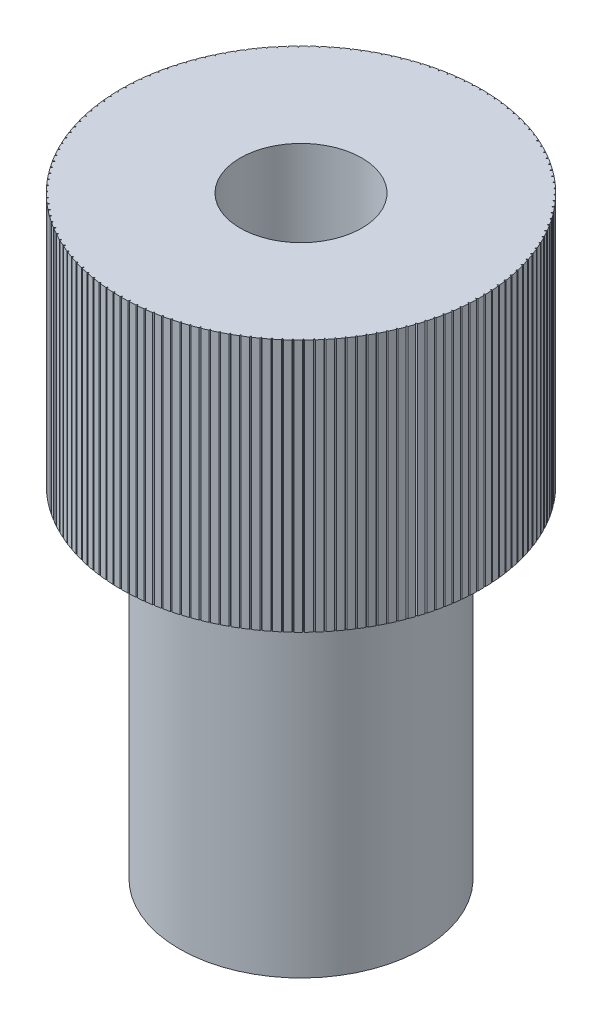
from build123d import *

# Parameters (mm, degrees)
CUT_EXTRUDE1_DEPTH = 17.85898093
SKETCH5_R          = 1.5875
CUT_EXTRUDE2_DEPTH = 17.858971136
CHAMFER1_SIZE      = 0.508
CHAMFER1_SIZE2     = 0.87988181


with BuildPart() as part:
    # Sketch1 → Revolve1 (revolve)
    with BuildSketch(Plane(origin=(0, 0, 0), x_dir=(0, 0, -1), z_dir=(1, 0, 0))):
        Polygon((4.699, 8.89), (3.175, 8.89), (3.175, 0), (0, 0), (0, 15.494), (4.699, 15.494), align=None)
    revolve(axis=Axis((0, 0, 0), (0, 1, 0)))

    # Sketch2 → Cut-Extrude1 (cut, through all)
    with BuildSketch(Plane(origin=(0, 15.494, 0), x_dir=(1, 0, 0), z_dir=(0, 1, 0))):
        with BuildLine():
            Line((0.01817215, 4.698964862), (0, 4.654012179))
            Line((0, 4.654012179), (-0.01817215, 4.698964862))
            ThreePointArc((-0.01817215, 4.698964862), (0, 4.699), (0.01817215, 4.698964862))
        make_face()
        with BuildLine():
            Line((0.214928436, 4.694082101), (0.194889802, 4.64992982))
            Line((0.194889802, 4.64992982), (0.178616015, 4.695604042))
            ThreePointArc((0.178616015, 4.695604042), (0.196773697, 4.694878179), (0.214928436, 4.694082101))
        make_face()
        with BuildLine():
            Line((0.411307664, 4.680964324), (0.389437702, 4.637689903))
            Line((0.389437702, 4.637689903), (0.375090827, 4.684005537))
            ThreePointArc((0.375090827, 4.684005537), (0.393202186, 4.682519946), (0.411307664, 4.680964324))
        make_face()
        with BuildLine():
            Line((0.606965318, 4.659634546), (0.583302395, 4.617313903))
            Line((0.583302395, 4.617313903), (0.570907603, 4.664189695))
            ThreePointArc((0.570907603, 4.664189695), (0.588940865, 4.661946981), (0.606965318, 4.659634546))
        make_face()
        with BuildLine():
            Line((0.801558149, 4.630130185), (0.776143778, 4.588837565))
            Line((0.776143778, 4.588837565), (0.765722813, 4.636191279))
            ThreePointArc((0.765722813, 4.636191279), (0.783646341, 4.633195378), (0.801558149, 4.630130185))
        make_face()
        with BuildLine():
            Line((0.994744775, 4.592503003), (0.967623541, 4.552310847))
            Line((0.967623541, 4.552310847), (0.959194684, 4.600059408))
            ThreePointArc((0.959194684, 4.600059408), (0.976977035, 4.596315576), (0.994744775, 4.592503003))
        make_face()
        with BuildLine():
            Line((1.18618628, 4.54681901), (1.157405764, 4.507797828))
            Line((1.157405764, 4.507797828), (1.150983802, 4.55585747))
            ThreePointArc((1.150983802, 4.55585747), (1.16859378, 4.551372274), (1.18618628, 4.54681901))
        make_face()
        with BuildLine():
            Line((1.375546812, 4.493158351), (1.345157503, 4.455376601))
            Line((1.345157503, 4.455376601), (1.340753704, 4.50366301))
            ThreePointArc((1.340753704, 4.50366301), (1.358160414, 4.498444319), (1.375546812, 4.493158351))
        make_face()
        with BuildLine():
            Line((1.562494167, 4.431615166), (1.530549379, 4.395139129))
            Line((1.530549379, 4.395139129), (1.528171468, 4.443567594))
            ThreePointArc((1.528171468, 4.443567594), (1.545344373, 4.437624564), (1.562494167, 4.431615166))
        make_face()
        with BuildLine():
            Line((1.746700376, 4.362297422), (1.713256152, 4.327191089))
            Line((1.713256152, 4.327191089), (1.7129083, 4.375676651))
            ThreePointArc((1.7129083, 4.375676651), (1.729817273, 4.369019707), (1.746700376, 4.362297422))
        make_face()
        with BuildLine():
            Line((1.927842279, 4.285326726), (1.892957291, 4.251651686))
            Line((1.892957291, 4.251651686), (1.894640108, 4.300109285))
            ThreePointArc((1.894640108, 4.300109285), (1.911255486, 4.292750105), (1.927842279, 4.285326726))
        make_face()
        with BuildLine():
            Line((2.105602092, 4.20083811), (2.069337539, 4.168653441))
            Line((2.069337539, 4.168653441), (2.073048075, 4.216998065))
            ThreePointArc((2.073048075, 4.216998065), (2.089340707, 4.208949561), (2.105602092, 4.20083811))
        make_face()
        with BuildLine():
            Line((2.279667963, 4.108979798), (2.242087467, 4.078341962))
            Line((2.242087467, 4.078341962), (2.24781921, 4.126488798))
            ThreePointArc((2.24781921, 4.126488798), (2.263760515, 4.11776509), (2.279667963, 4.108979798))
        make_face()
        with BuildLine():
            Line((2.449734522, 4.009912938), (2.410904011, 3.980875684))
            Line((2.410904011, 3.980875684), (2.418646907, 4.028740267))
            ThreePointArc((2.418646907, 4.028740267), (2.434208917, 4.019356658), (2.449734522, 4.009912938))
        make_face()
        with BuildLine():
            Line((2.615503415, 3.903811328), (2.57549101, 3.876425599))
            Line((2.57549101, 3.876425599), (2.585231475, 3.923923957))
            ThreePointArc((2.585231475, 3.923923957), (2.60038689, 3.91389691), (2.615503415, 3.903811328))
        make_face()
        with BuildLine():
            Line((2.776683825, 3.790861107), (2.735559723, 3.765174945))
            Line((2.735559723, 3.765174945), (2.747280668, 3.812223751))
            ThreePointArc((2.747280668, 3.812223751), (2.762002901, 3.801570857), (2.776683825, 3.790861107))
        make_face()
        with BuildLine():
            Line((2.932992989, 3.671260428), (2.890829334, 3.647318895))
            Line((2.890829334, 3.647318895), (2.904510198, 3.693835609))
            ThreePointArc((2.904510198, 3.693835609), (2.91877342, 3.682575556), (2.932992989, 3.671260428))
        make_face()
        with BuildLine():
            Line((3.084156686, 3.54521911), (3.041027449, 3.523064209))
            Line((3.041027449, 3.523064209), (3.05664423, 3.568967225))
            ThreePointArc((3.05664423, 3.568967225), (3.070423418, 3.557119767), (3.084156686, 3.54521911))
        make_face()
        with BuildLine():
            Line((3.229909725, 3.412958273), (3.185890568, 3.39262887))
            Line((3.185890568, 3.39262887), (3.20341587, 3.437837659))
            ThreePointArc((3.20341587, 3.437837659), (3.216686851, 3.42542358), (3.229909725, 3.412958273))
        make_face()
        with BuildLine():
            Line((3.369996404, 3.274709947), (3.325164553, 3.256241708))
            Line((3.325164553, 3.256241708), (3.344567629, 3.300676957))
            ThreePointArc((3.344567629, 3.300676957), (3.357307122, 3.287718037), (3.369996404, 3.274709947))
        make_face()
        with BuildLine():
            Line((3.504170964, 3.130716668), (3.458605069, 3.114141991))
            Line((3.458605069, 3.114141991), (3.47985188, 3.157725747))
            ThreePointArc((3.47985188, 3.157725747), (3.492037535, 3.144244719), (3.504170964, 3.130716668))
        make_face()
        with BuildLine():
            Line((3.632198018, 2.981231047), (3.585978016, 2.966579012))
            Line((3.585978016, 2.966579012), (3.609031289, 3.009234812))
            ThreePointArc((3.609031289, 3.009234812), (3.620641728, 2.995255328), (3.632198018, 2.981231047))
        make_face()
        with BuildLine():
            Line((3.753852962, 2.826515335), (3.70705994, 2.813811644))
            Line((3.70705994, 2.813811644), (3.73187923, 2.855464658))
            ThreePointArc((3.73187923, 2.855464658), (3.742894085, 2.841011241), (3.753852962, 2.826515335))
        make_face()
        with BuildLine():
            Line((3.868922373, 2.666840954), (3.82163842, 2.656107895))
            Line((3.82163842, 2.656107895), (3.848180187, 2.696685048))
            ThreePointArc((3.848180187, 2.696685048), (3.858580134, 2.681783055), (3.868922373, 2.666840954))
        make_face()
        with BuildLine():
            Line((3.977204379, 2.502488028), (3.929512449, 2.49374443))
            Line((3.929512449, 2.49374443), (3.957730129, 2.533174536))
            ThreePointArc((3.957730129, 2.533174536), (3.967496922, 2.51785011), (3.977204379, 2.502488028))
        make_face()
        with BuildLine():
            Line((4.078509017, 2.333744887), (4.030492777, 2.32700609))
            Line((4.030492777, 2.32700609), (4.060336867, 2.365219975))
            ThreePointArc((4.060336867, 2.365219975), (4.069453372, 2.3495), (4.078509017, 2.333744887))
        make_face()
        with BuildLine():
            Line((4.172658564, 2.160907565), (4.124402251, 2.15618539))
            Line((4.124402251, 2.15618539), (4.155820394, 2.193116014))
            ThreePointArc((4.155820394, 2.193116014), (4.164270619, 2.177028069), (4.172658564, 2.160907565))
        make_face()
        with BuildLine():
            Line((4.259487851, 1.984279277), (4.211076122, 1.981582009))
            Line((4.211076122, 1.981582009), (4.2440132, 2.017164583))
            ThreePointArc((4.2440132, 2.017164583), (4.25178232, 2.000736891), (4.259487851, 1.984279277))
        make_face()
        with BuildLine():
            Line((4.338844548, 1.804169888), (4.290362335, 1.803502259))
            Line((4.290362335, 1.803502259), (4.324760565, 1.83767436))
            ThreePointArc((4.324760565, 1.83767436), (4.331834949, 1.820935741), (4.338844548, 1.804169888))
        make_face()
        with BuildLine():
            Line((4.410589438, 1.620895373), (4.362121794, 1.622258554))
            Line((4.362121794, 1.622258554), (4.397920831, 1.654960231))
            ThreePointArc((4.397920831, 1.654960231), (4.404288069, 1.63794005), (4.410589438, 1.620895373))
        make_face()
        with BuildLine():
            Line((4.474596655, 1.434777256), (4.42622861, 1.438168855))
            Line((4.42622861, 1.438168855), (4.463365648, 1.46934274))
            ThreePointArc((4.463365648, 1.46934274), (4.46901457, 1.452070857), (4.474596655, 1.434777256))
        make_face()
        with BuildLine():
            Line((4.530753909, 1.246142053), (4.482570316, 1.25155612))
            Line((4.482570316, 1.25155612), (4.520980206, 1.281147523))
            ThreePointArc((4.520980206, 1.281147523), (4.525900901, 1.263654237), (4.530753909, 1.246142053))
        make_face()
        with BuildLine():
            Line((4.578962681, 1.055320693), (4.531048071, 1.062747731))
            Line((4.531048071, 1.062747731), (4.570663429, 1.090704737))
            ThreePointArc((4.570663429, 1.090704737), (4.574847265, 1.073020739), (4.578962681, 1.055320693))
        make_face()
        with BuildLine():
            Line((4.619138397, 0.862647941), (4.571576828, 0.87207492))
            Line((4.571576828, 0.87207492), (4.612328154, 0.898348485))
            ThreePointArc((4.612328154, 0.898348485), (4.615767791, 0.880504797), (4.619138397, 0.862647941))
        make_face()
        with BuildLine():
            Line((4.651210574, 0.668461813), (4.604085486, 0.679872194))
            Line((4.604085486, 0.679872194), (4.645901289, 0.704416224))
            ThreePointArc((4.645901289, 0.704416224), (4.648590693, 0.686444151), (4.651210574, 0.668461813))
        make_face()
        with BuildLine():
            Line((4.675122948, 0.473102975), (4.628517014, 0.486476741))
            Line((4.628517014, 0.486476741), (4.671323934, 0.509248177))
            ThreePointArc((4.671323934, 0.509248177), (4.673258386, 0.491179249), (4.675122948, 0.473102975))
        make_face()
        with BuildLine():
            Line((4.690833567, 0.276914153), (4.644828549, 0.292227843))
            Line((4.644828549, 0.292227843), (4.688551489, 0.313186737))
            ThreePointArc((4.688551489, 0.313186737), (4.689727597, 0.295052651), (4.690833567, 0.276914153))
        make_face()
        with BuildLine():
            Line((4.69831487, 0.08023953), (4.652991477, 0.097466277))
            Line((4.652991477, 0.097466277), (4.697553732, 0.11657586))
            ThreePointArc((4.697553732, 0.11657586), (4.697969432, 0.098408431), (4.69831487, 0.08023953))
        make_face()
        with BuildLine():
            Line((4.697553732, -0.11657586), (4.652991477, -0.097466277))
            Line((4.652991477, -0.097466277), (4.69831487, -0.08023953))
            ThreePointArc((4.69831487, -0.08023953), (4.697969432, -0.098408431), (4.697553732, -0.11657586))
        make_face()
        with BuildLine():
            Line((4.688551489, -0.313186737), (4.644828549, -0.292227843))
            Line((4.644828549, -0.292227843), (4.690833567, -0.276914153))
            ThreePointArc((4.690833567, -0.276914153), (4.689727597, -0.295052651), (4.688551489, -0.313186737))
        make_face()
        with BuildLine():
            Line((4.671323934, -0.509248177), (4.628517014, -0.486476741))
            Line((4.628517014, -0.486476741), (4.675122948, -0.473102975))
            ThreePointArc((4.675122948, -0.473102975), (4.673258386, -0.491179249), (4.671323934, -0.509248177))
        make_face()
        with BuildLine():
            Line((4.645901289, -0.704416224), (4.604085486, -0.679872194))
            Line((4.604085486, -0.679872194), (4.651210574, -0.668461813))
            ThreePointArc((4.651210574, -0.668461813), (4.648590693, -0.686444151), (4.645901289, -0.704416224))
        make_face()
        with BuildLine():
            Line((4.612328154, -0.898348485), (4.571576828, -0.87207492))
            Line((4.571576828, -0.87207492), (4.619138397, -0.862647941))
            ThreePointArc((4.619138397, -0.862647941), (4.615767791, -0.880504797), (4.612328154, -0.898348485))
        make_face()
        with BuildLine():
            Line((4.570663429, -1.090704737), (4.531048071, -1.062747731))
            Line((4.531048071, -1.062747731), (4.578962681, -1.055320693))
            ThreePointArc((4.578962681, -1.055320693), (4.574847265, -1.073020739), (4.570663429, -1.090704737))
        make_face()
        with BuildLine():
            Line((4.520980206, -1.281147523), (4.482570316, -1.25155612))
            Line((4.482570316, -1.25155612), (4.530753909, -1.246142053))
            ThreePointArc((4.530753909, -1.246142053), (4.525900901, -1.263654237), (4.520980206, -1.281147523))
        make_face()
        with BuildLine():
            Line((4.463365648, -1.46934274), (4.42622861, -1.438168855))
            Line((4.42622861, -1.438168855), (4.474596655, -1.434777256))
            ThreePointArc((4.474596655, -1.434777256), (4.46901457, -1.452070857), (4.463365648, -1.46934274))
        make_face()
        with BuildLine():
            Line((4.397920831, -1.654960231), (4.362121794, -1.622258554))
            Line((4.362121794, -1.622258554), (4.410589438, -1.620895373))
            ThreePointArc((4.410589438, -1.620895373), (4.404288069, -1.63794005), (4.397920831, -1.654960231))
        make_face()
        with BuildLine():
            Line((4.324760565, -1.83767436), (4.290362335, -1.803502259))
            Line((4.290362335, -1.803502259), (4.338844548, -1.804169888))
            ThreePointArc((4.338844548, -1.804169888), (4.331834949, -1.820935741), (4.324760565, -1.83767436))
        make_face()
        with BuildLine():
            Line((4.2440132, -2.017164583), (4.211076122, -1.981582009))
            Line((4.211076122, -1.981582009), (4.259487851, -1.984279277))
            ThreePointArc((4.259487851, -1.984279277), (4.25178232, -2.000736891), (4.2440132, -2.017164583))
        make_face()
        with BuildLine():
            Line((4.155820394, -2.193116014), (4.124402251, -2.15618539))
            Line((4.124402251, -2.15618539), (4.172658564, -2.160907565))
            ThreePointArc((4.172658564, -2.160907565), (4.164270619, -2.177028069), (4.155820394, -2.193116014))
        make_face()
        with BuildLine():
            Line((4.060336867, -2.365219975), (4.030492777, -2.32700609))
            Line((4.030492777, -2.32700609), (4.078509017, -2.333744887))
            ThreePointArc((4.078509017, -2.333744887), (4.069453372, -2.3495), (4.060336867, -2.365219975))
        make_face()
        with BuildLine():
            Line((3.957730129, -2.533174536), (3.929512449, -2.49374443))
            Line((3.929512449, -2.49374443), (3.977204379, -2.502488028))
            ThreePointArc((3.977204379, -2.502488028), (3.967496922, -2.51785011), (3.957730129, -2.533174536))
        make_face()
        with BuildLine():
            Line((3.848180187, -2.696685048), (3.82163842, -2.656107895))
            Line((3.82163842, -2.656107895), (3.868922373, -2.666840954))
            ThreePointArc((3.868922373, -2.666840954), (3.858580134, -2.681783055), (3.848180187, -2.696685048))
        make_face()
        with BuildLine():
            Line((3.73187923, -2.855464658), (3.70705994, -2.813811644))
            Line((3.70705994, -2.813811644), (3.753852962, -2.826515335))
            ThreePointArc((3.753852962, -2.826515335), (3.742894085, -2.841011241), (3.73187923, -2.855464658))
        make_face()
        with BuildLine():
            Line((3.609031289, -3.009234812), (3.585978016, -2.966579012))
            Line((3.585978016, -2.966579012), (3.632198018, -2.981231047))
            ThreePointArc((3.632198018, -2.981231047), (3.620641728, -2.995255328), (3.609031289, -3.009234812))
        make_face()
        with BuildLine():
            Line((3.47985188, -3.157725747), (3.458605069, -3.114141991))
            Line((3.458605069, -3.114141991), (3.504170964, -3.130716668))
            ThreePointArc((3.504170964, -3.130716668), (3.492037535, -3.144244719), (3.47985188, -3.157725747))
        make_face()
        with BuildLine():
            Line((3.344567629, -3.300676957), (3.325164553, -3.256241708))
            Line((3.325164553, -3.256241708), (3.369996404, -3.274709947))
            ThreePointArc((3.369996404, -3.274709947), (3.357307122, -3.287718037), (3.344567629, -3.300676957))
        make_face()
        with BuildLine():
            Line((3.20341587, -3.437837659), (3.185890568, -3.39262887))
            Line((3.185890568, -3.39262887), (3.229909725, -3.412958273))
            ThreePointArc((3.229909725, -3.412958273), (3.216686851, -3.42542358), (3.20341587, -3.437837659))
        make_face()
        with BuildLine():
            Line((3.05664423, -3.568967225), (3.041027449, -3.523064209))
            Line((3.041027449, -3.523064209), (3.084156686, -3.54521911))
            ThreePointArc((3.084156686, -3.54521911), (3.070423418, -3.557119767), (3.05664423, -3.568967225))
        make_face()
        with BuildLine():
            Line((2.904510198, -3.693835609), (2.890829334, -3.647318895))
            Line((2.890829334, -3.647318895), (2.932992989, -3.671260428))
            ThreePointArc((2.932992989, -3.671260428), (2.91877342, -3.682575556), (2.904510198, -3.693835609))
        make_face()
        with BuildLine():
            Line((2.747280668, -3.812223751), (2.735559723, -3.765174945))
            Line((2.735559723, -3.765174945), (2.776683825, -3.790861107))
            ThreePointArc((2.776683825, -3.790861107), (2.762002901, -3.801570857), (2.747280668, -3.812223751))
        make_face()
        with BuildLine():
            Line((2.585231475, -3.923923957), (2.57549101, -3.876425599))
            Line((2.57549101, -3.876425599), (2.615503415, -3.903811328))
            ThreePointArc((2.615503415, -3.903811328), (2.60038689, -3.91389691), (2.585231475, -3.923923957))
        make_face()
        with BuildLine():
            Line((2.418646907, -4.028740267), (2.410904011, -3.980875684))
            Line((2.410904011, -3.980875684), (2.449734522, -4.009912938))
            ThreePointArc((2.449734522, -4.009912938), (2.434208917, -4.019356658), (2.418646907, -4.028740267))
        make_face()
        with BuildLine():
            Line((2.24781921, -4.126488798), (2.242087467, -4.078341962))
            Line((2.242087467, -4.078341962), (2.279667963, -4.108979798))
            ThreePointArc((2.279667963, -4.108979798), (2.263760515, -4.11776509), (2.24781921, -4.126488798))
        make_face()
        with BuildLine():
            Line((2.073048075, -4.216998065), (2.069337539, -4.168653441))
            Line((2.069337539, -4.168653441), (2.105602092, -4.20083811))
            ThreePointArc((2.105602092, -4.20083811), (2.089340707, -4.208949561), (2.073048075, -4.216998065))
        make_face()
        with BuildLine():
            Line((1.894640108, -4.300109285), (1.892957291, -4.251651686))
            Line((1.892957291, -4.251651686), (1.927842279, -4.285326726))
            ThreePointArc((1.927842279, -4.285326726), (1.911255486, -4.292750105), (1.894640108, -4.300109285))
        make_face()
        with BuildLine():
            Line((1.7129083, -4.375676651), (1.713256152, -4.327191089))
            Line((1.713256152, -4.327191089), (1.746700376, -4.362297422))
            ThreePointArc((1.746700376, -4.362297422), (1.729817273, -4.369019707), (1.7129083, -4.375676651))
        make_face()
        with BuildLine():
            Line((1.528171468, -4.443567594), (1.530549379, -4.395139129))
            Line((1.530549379, -4.395139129), (1.562494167, -4.431615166))
            ThreePointArc((1.562494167, -4.431615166), (1.545344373, -4.437624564), (1.528171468, -4.443567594))
        make_face()
        with BuildLine():
            Line((1.340753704, -4.50366301), (1.345157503, -4.455376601))
            Line((1.345157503, -4.455376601), (1.375546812, -4.493158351))
            ThreePointArc((1.375546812, -4.493158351), (1.358160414, -4.498444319), (1.340753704, -4.50366301))
        make_face()
        with BuildLine():
            Line((1.150983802, -4.55585747), (1.157405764, -4.507797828))
            Line((1.157405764, -4.507797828), (1.18618628, -4.54681901))
            ThreePointArc((1.18618628, -4.54681901), (1.16859378, -4.551372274), (1.150983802, -4.55585747))
        make_face()
        with BuildLine():
            Line((0.959194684, -4.600059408), (0.967623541, -4.552310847))
            Line((0.967623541, -4.552310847), (0.994744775, -4.592503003))
            ThreePointArc((0.994744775, -4.592503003), (0.976977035, -4.596315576), (0.959194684, -4.600059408))
        make_face()
        with BuildLine():
            Line((0.765722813, -4.636191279), (0.776143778, -4.588837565))
            Line((0.776143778, -4.588837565), (0.801558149, -4.630130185))
            ThreePointArc((0.801558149, -4.630130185), (0.783646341, -4.633195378), (0.765722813, -4.636191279))
        make_face()
        with BuildLine():
            Line((0.570907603, -4.664189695), (0.583302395, -4.617313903))
            Line((0.583302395, -4.617313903), (0.606965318, -4.659634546))
            ThreePointArc((0.606965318, -4.659634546), (0.588940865, -4.661946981), (0.570907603, -4.664189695))
        make_face()
        with BuildLine():
            Line((0.375090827, -4.684005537), (0.389437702, -4.637689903))
            Line((0.389437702, -4.637689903), (0.411307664, -4.680964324))
            ThreePointArc((0.411307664, -4.680964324), (0.393202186, -4.682519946), (0.375090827, -4.684005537))
        make_face()
        with BuildLine():
            Line((0.178616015, -4.695604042), (0.194889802, -4.64992982))
            Line((0.194889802, -4.64992982), (0.214928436, -4.694082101))
            ThreePointArc((0.214928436, -4.694082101), (0.196773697, -4.694878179), (0.178616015, -4.695604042))
        make_face()
        with BuildLine():
            Line((-0.01817215, -4.698964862), (0, -4.654012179))
            Line((0, -4.654012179), (0.01817215, -4.698964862))
            ThreePointArc((0.01817215, -4.698964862), (0, -4.699), (-0.01817215, -4.698964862))
        make_face()
        with BuildLine():
            Line((-0.214928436, -4.694082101), (-0.194889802, -4.64992982))
            Line((-0.194889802, -4.64992982), (-0.178616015, -4.695604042))
            ThreePointArc((-0.178616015, -4.695604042), (-0.196773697, -4.694878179), (-0.214928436, -4.694082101))
        make_face()
        with BuildLine():
            Line((-0.411307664, -4.680964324), (-0.389437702, -4.637689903))
            Line((-0.389437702, -4.637689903), (-0.375090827, -4.684005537))
            ThreePointArc((-0.375090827, -4.684005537), (-0.393202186, -4.682519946), (-0.411307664, -4.680964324))
        make_face()
        with BuildLine():
            Line((-0.606965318, -4.659634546), (-0.583302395, -4.617313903))
            Line((-0.583302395, -4.617313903), (-0.570907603, -4.664189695))
            ThreePointArc((-0.570907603, -4.664189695), (-0.588940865, -4.661946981), (-0.606965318, -4.659634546))
        make_face()
        with BuildLine():
            Line((-0.801558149, -4.630130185), (-0.776143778, -4.588837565))
            Line((-0.776143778, -4.588837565), (-0.765722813, -4.636191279))
            ThreePointArc((-0.765722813, -4.636191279), (-0.783646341, -4.633195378), (-0.801558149, -4.630130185))
        make_face()
        with BuildLine():
            Line((-0.994744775, -4.592503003), (-0.967623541, -4.552310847))
            Line((-0.967623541, -4.552310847), (-0.959194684, -4.600059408))
            ThreePointArc((-0.959194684, -4.600059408), (-0.976977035, -4.596315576), (-0.994744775, -4.592503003))
        make_face()
        with BuildLine():
            Line((-1.18618628, -4.54681901), (-1.157405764, -4.507797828))
            Line((-1.157405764, -4.507797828), (-1.150983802, -4.55585747))
            ThreePointArc((-1.150983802, -4.55585747), (-1.16859378, -4.551372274), (-1.18618628, -4.54681901))
        make_face()
        with BuildLine():
            Line((-1.375546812, -4.493158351), (-1.345157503, -4.455376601))
            Line((-1.345157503, -4.455376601), (-1.340753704, -4.50366301))
            ThreePointArc((-1.340753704, -4.50366301), (-1.358160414, -4.498444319), (-1.375546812, -4.493158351))
        make_face()
        with BuildLine():
            Line((-1.562494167, -4.431615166), (-1.530549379, -4.395139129))
            Line((-1.530549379, -4.395139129), (-1.528171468, -4.443567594))
            ThreePointArc((-1.528171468, -4.443567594), (-1.545344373, -4.437624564), (-1.562494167, -4.431615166))
        make_face()
        with BuildLine():
            Line((-1.746700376, -4.362297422), (-1.713256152, -4.327191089))
            Line((-1.713256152, -4.327191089), (-1.7129083, -4.375676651))
            ThreePointArc((-1.7129083, -4.375676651), (-1.729817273, -4.369019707), (-1.746700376, -4.362297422))
        make_face()
        with BuildLine():
            Line((-1.927842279, -4.285326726), (-1.892957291, -4.251651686))
            Line((-1.892957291, -4.251651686), (-1.894640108, -4.300109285))
            ThreePointArc((-1.894640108, -4.300109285), (-1.911255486, -4.292750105), (-1.927842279, -4.285326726))
        make_face()
        with BuildLine():
            Line((-2.105602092, -4.20083811), (-2.069337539, -4.168653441))
            Line((-2.069337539, -4.168653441), (-2.073048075, -4.216998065))
            ThreePointArc((-2.073048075, -4.216998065), (-2.089340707, -4.208949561), (-2.105602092, -4.20083811))
        make_face()
        with BuildLine():
            Line((-2.279667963, -4.108979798), (-2.242087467, -4.078341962))
            Line((-2.242087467, -4.078341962), (-2.24781921, -4.126488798))
            ThreePointArc((-2.24781921, -4.126488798), (-2.263760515, -4.11776509), (-2.279667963, -4.108979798))
        make_face()
        with BuildLine():
            Line((-2.449734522, -4.009912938), (-2.410904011, -3.980875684))
            Line((-2.410904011, -3.980875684), (-2.418646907, -4.028740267))
            ThreePointArc((-2.418646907, -4.028740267), (-2.434208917, -4.019356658), (-2.449734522, -4.009912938))
        make_face()
        with BuildLine():
            Line((-2.615503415, -3.903811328), (-2.57549101, -3.876425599))
            Line((-2.57549101, -3.876425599), (-2.585231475, -3.923923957))
            ThreePointArc((-2.585231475, -3.923923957), (-2.60038689, -3.91389691), (-2.615503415, -3.903811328))
        make_face()
        with BuildLine():
            Line((-2.776683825, -3.790861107), (-2.735559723, -3.765174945))
            Line((-2.735559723, -3.765174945), (-2.747280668, -3.812223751))
            ThreePointArc((-2.747280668, -3.812223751), (-2.762002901, -3.801570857), (-2.776683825, -3.790861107))
        make_face()
        with BuildLine():
            Line((-2.932992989, -3.671260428), (-2.890829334, -3.647318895))
            Line((-2.890829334, -3.647318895), (-2.904510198, -3.693835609))
            ThreePointArc((-2.904510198, -3.693835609), (-2.91877342, -3.682575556), (-2.932992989, -3.671260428))
        make_face()
        with BuildLine():
            Line((-3.084156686, -3.54521911), (-3.041027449, -3.523064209))
            Line((-3.041027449, -3.523064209), (-3.05664423, -3.568967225))
            ThreePointArc((-3.05664423, -3.568967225), (-3.070423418, -3.557119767), (-3.084156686, -3.54521911))
        make_face()
        with BuildLine():
            Line((-3.229909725, -3.412958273), (-3.185890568, -3.39262887))
            Line((-3.185890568, -3.39262887), (-3.20341587, -3.437837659))
            ThreePointArc((-3.20341587, -3.437837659), (-3.216686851, -3.42542358), (-3.229909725, -3.412958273))
        make_face()
        with BuildLine():
            Line((-3.369996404, -3.274709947), (-3.325164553, -3.256241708))
            Line((-3.325164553, -3.256241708), (-3.344567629, -3.300676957))
            ThreePointArc((-3.344567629, -3.300676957), (-3.357307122, -3.287718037), (-3.369996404, -3.274709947))
        make_face()
        with BuildLine():
            Line((-3.504170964, -3.130716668), (-3.458605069, -3.114141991))
            Line((-3.458605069, -3.114141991), (-3.47985188, -3.157725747))
            ThreePointArc((-3.47985188, -3.157725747), (-3.492037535, -3.144244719), (-3.504170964, -3.130716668))
        make_face()
        with BuildLine():
            Line((-3.632198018, -2.981231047), (-3.585978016, -2.966579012))
            Line((-3.585978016, -2.966579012), (-3.609031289, -3.009234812))
            ThreePointArc((-3.609031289, -3.009234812), (-3.620641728, -2.995255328), (-3.632198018, -2.981231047))
        make_face()
        with BuildLine():
            Line((-3.753852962, -2.826515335), (-3.70705994, -2.813811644))
            Line((-3.70705994, -2.813811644), (-3.73187923, -2.855464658))
            ThreePointArc((-3.73187923, -2.855464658), (-3.742894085, -2.841011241), (-3.753852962, -2.826515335))
        make_face()
        with BuildLine():
            Line((-3.868922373, -2.666840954), (-3.82163842, -2.656107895))
            Line((-3.82163842, -2.656107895), (-3.848180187, -2.696685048))
            ThreePointArc((-3.848180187, -2.696685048), (-3.858580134, -2.681783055), (-3.868922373, -2.666840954))
        make_face()
        with BuildLine():
            Line((-3.977204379, -2.502488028), (-3.929512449, -2.49374443))
            Line((-3.929512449, -2.49374443), (-3.957730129, -2.533174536))
            ThreePointArc((-3.957730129, -2.533174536), (-3.967496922, -2.51785011), (-3.977204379, -2.502488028))
        make_face()
        with BuildLine():
            Line((-4.078509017, -2.333744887), (-4.030492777, -2.32700609))
            Line((-4.030492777, -2.32700609), (-4.060336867, -2.365219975))
            ThreePointArc((-4.060336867, -2.365219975), (-4.069453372, -2.3495), (-4.078509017, -2.333744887))
        make_face()
        with BuildLine():
            Line((-4.172658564, -2.160907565), (-4.124402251, -2.15618539))
            Line((-4.124402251, -2.15618539), (-4.155820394, -2.193116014))
            ThreePointArc((-4.155820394, -2.193116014), (-4.164270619, -2.177028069), (-4.172658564, -2.160907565))
        make_face()
        with BuildLine():
            Line((-4.259487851, -1.984279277), (-4.211076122, -1.981582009))
            Line((-4.211076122, -1.981582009), (-4.2440132, -2.017164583))
            ThreePointArc((-4.2440132, -2.017164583), (-4.25178232, -2.000736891), (-4.259487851, -1.984279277))
        make_face()
        with BuildLine():
            Line((-4.338844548, -1.804169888), (-4.290362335, -1.803502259))
            Line((-4.290362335, -1.803502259), (-4.324760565, -1.83767436))
            ThreePointArc((-4.324760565, -1.83767436), (-4.331834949, -1.820935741), (-4.338844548, -1.804169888))
        make_face()
        with BuildLine():
            Line((-4.410589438, -1.620895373), (-4.362121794, -1.622258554))
            Line((-4.362121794, -1.622258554), (-4.397920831, -1.654960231))
            ThreePointArc((-4.397920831, -1.654960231), (-4.404288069, -1.63794005), (-4.410589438, -1.620895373))
        make_face()
        with BuildLine():
            Line((-4.474596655, -1.434777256), (-4.42622861, -1.438168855))
            Line((-4.42622861, -1.438168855), (-4.463365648, -1.46934274))
            ThreePointArc((-4.463365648, -1.46934274), (-4.46901457, -1.452070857), (-4.474596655, -1.434777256))
        make_face()
        with BuildLine():
            Line((-4.530753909, -1.246142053), (-4.482570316, -1.25155612))
            Line((-4.482570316, -1.25155612), (-4.520980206, -1.281147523))
            ThreePointArc((-4.520980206, -1.281147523), (-4.525900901, -1.263654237), (-4.530753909, -1.246142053))
        make_face()
        with BuildLine():
            Line((-4.578962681, -1.055320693), (-4.531048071, -1.062747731))
            Line((-4.531048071, -1.062747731), (-4.570663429, -1.090704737))
            ThreePointArc((-4.570663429, -1.090704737), (-4.574847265, -1.073020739), (-4.578962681, -1.055320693))
        make_face()
        with BuildLine():
            Line((-4.619138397, -0.862647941), (-4.571576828, -0.87207492))
            Line((-4.571576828, -0.87207492), (-4.612328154, -0.898348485))
            ThreePointArc((-4.612328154, -0.898348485), (-4.615767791, -0.880504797), (-4.619138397, -0.862647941))
        make_face()
        with BuildLine():
            Line((-4.651210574, -0.668461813), (-4.604085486, -0.679872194))
            Line((-4.604085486, -0.679872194), (-4.645901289, -0.704416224))
            ThreePointArc((-4.645901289, -0.704416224), (-4.648590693, -0.686444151), (-4.651210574, -0.668461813))
        make_face()
        with BuildLine():
            Line((-4.675122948, -0.473102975), (-4.628517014, -0.486476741))
            Line((-4.628517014, -0.486476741), (-4.671323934, -0.509248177))
            ThreePointArc((-4.671323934, -0.509248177), (-4.673258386, -0.491179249), (-4.675122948, -0.473102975))
        make_face()
        with BuildLine():
            Line((-4.690833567, -0.276914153), (-4.644828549, -0.292227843))
            Line((-4.644828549, -0.292227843), (-4.688551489, -0.313186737))
            ThreePointArc((-4.688551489, -0.313186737), (-4.689727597, -0.295052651), (-4.690833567, -0.276914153))
        make_face()
        with BuildLine():
            Line((-4.69831487, -0.08023953), (-4.652991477, -0.097466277))
            Line((-4.652991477, -0.097466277), (-4.697553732, -0.11657586))
            ThreePointArc((-4.697553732, -0.11657586), (-4.697969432, -0.098408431), (-4.69831487, -0.08023953))
        make_face()
        with BuildLine():
            Line((-4.697553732, 0.11657586), (-4.652991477, 0.097466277))
            Line((-4.652991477, 0.097466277), (-4.69831487, 0.08023953))
            ThreePointArc((-4.69831487, 0.08023953), (-4.697969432, 0.098408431), (-4.697553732, 0.11657586))
        make_face()
        with BuildLine():
            Line((-4.688551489, 0.313186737), (-4.644828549, 0.292227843))
            Line((-4.644828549, 0.292227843), (-4.690833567, 0.276914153))
            ThreePointArc((-4.690833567, 0.276914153), (-4.689727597, 0.295052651), (-4.688551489, 0.313186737))
        make_face()
        with BuildLine():
            Line((-4.671323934, 0.509248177), (-4.628517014, 0.486476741))
            Line((-4.628517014, 0.486476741), (-4.675122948, 0.473102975))
            ThreePointArc((-4.675122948, 0.473102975), (-4.673258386, 0.491179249), (-4.671323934, 0.509248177))
        make_face()
        with BuildLine():
            Line((-4.645901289, 0.704416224), (-4.604085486, 0.679872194))
            Line((-4.604085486, 0.679872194), (-4.651210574, 0.668461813))
            ThreePointArc((-4.651210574, 0.668461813), (-4.648590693, 0.686444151), (-4.645901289, 0.704416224))
        make_face()
        with BuildLine():
            Line((-4.612328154, 0.898348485), (-4.571576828, 0.87207492))
            Line((-4.571576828, 0.87207492), (-4.619138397, 0.862647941))
            ThreePointArc((-4.619138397, 0.862647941), (-4.615767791, 0.880504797), (-4.612328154, 0.898348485))
        make_face()
        with BuildLine():
            Line((-4.570663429, 1.090704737), (-4.531048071, 1.062747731))
            Line((-4.531048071, 1.062747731), (-4.578962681, 1.055320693))
            ThreePointArc((-4.578962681, 1.055320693), (-4.574847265, 1.073020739), (-4.570663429, 1.090704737))
        make_face()
        with BuildLine():
            Line((-4.520980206, 1.281147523), (-4.482570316, 1.25155612))
            Line((-4.482570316, 1.25155612), (-4.530753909, 1.246142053))
            ThreePointArc((-4.530753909, 1.246142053), (-4.525900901, 1.263654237), (-4.520980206, 1.281147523))
        make_face()
        with BuildLine():
            Line((-4.463365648, 1.46934274), (-4.42622861, 1.438168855))
            Line((-4.42622861, 1.438168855), (-4.474596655, 1.434777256))
            ThreePointArc((-4.474596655, 1.434777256), (-4.46901457, 1.452070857), (-4.463365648, 1.46934274))
        make_face()
        with BuildLine():
            Line((-4.397920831, 1.654960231), (-4.362121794, 1.622258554))
            Line((-4.362121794, 1.622258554), (-4.410589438, 1.620895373))
            ThreePointArc((-4.410589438, 1.620895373), (-4.404288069, 1.63794005), (-4.397920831, 1.654960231))
        make_face()
        with BuildLine():
            Line((-4.324760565, 1.83767436), (-4.290362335, 1.803502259))
            Line((-4.290362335, 1.803502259), (-4.338844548, 1.804169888))
            ThreePointArc((-4.338844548, 1.804169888), (-4.331834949, 1.820935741), (-4.324760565, 1.83767436))
        make_face()
        with BuildLine():
            Line((-4.2440132, 2.017164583), (-4.211076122, 1.981582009))
            Line((-4.211076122, 1.981582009), (-4.259487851, 1.984279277))
            ThreePointArc((-4.259487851, 1.984279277), (-4.25178232, 2.000736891), (-4.2440132, 2.017164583))
        make_face()
        with BuildLine():
            Line((-4.155820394, 2.193116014), (-4.124402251, 2.15618539))
            Line((-4.124402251, 2.15618539), (-4.172658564, 2.160907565))
            ThreePointArc((-4.172658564, 2.160907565), (-4.164270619, 2.177028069), (-4.155820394, 2.193116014))
        make_face()
        with BuildLine():
            Line((-4.060336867, 2.365219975), (-4.030492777, 2.32700609))
            Line((-4.030492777, 2.32700609), (-4.078509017, 2.333744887))
            ThreePointArc((-4.078509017, 2.333744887), (-4.069453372, 2.3495), (-4.060336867, 2.365219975))
        make_face()
        with BuildLine():
            Line((-3.957730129, 2.533174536), (-3.929512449, 2.49374443))
            Line((-3.929512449, 2.49374443), (-3.977204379, 2.502488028))
            ThreePointArc((-3.977204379, 2.502488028), (-3.967496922, 2.51785011), (-3.957730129, 2.533174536))
        make_face()
        with BuildLine():
            Line((-3.848180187, 2.696685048), (-3.82163842, 2.656107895))
            Line((-3.82163842, 2.656107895), (-3.868922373, 2.666840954))
            ThreePointArc((-3.868922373, 2.666840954), (-3.858580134, 2.681783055), (-3.848180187, 2.696685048))
        make_face()
        with BuildLine():
            Line((-3.73187923, 2.855464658), (-3.70705994, 2.813811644))
            Line((-3.70705994, 2.813811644), (-3.753852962, 2.826515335))
            ThreePointArc((-3.753852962, 2.826515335), (-3.742894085, 2.841011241), (-3.73187923, 2.855464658))
        make_face()
        with BuildLine():
            Line((-3.609031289, 3.009234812), (-3.585978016, 2.966579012))
            Line((-3.585978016, 2.966579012), (-3.632198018, 2.981231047))
            ThreePointArc((-3.632198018, 2.981231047), (-3.620641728, 2.995255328), (-3.609031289, 3.009234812))
        make_face()
        with BuildLine():
            Line((-3.47985188, 3.157725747), (-3.458605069, 3.114141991))
            Line((-3.458605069, 3.114141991), (-3.504170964, 3.130716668))
            ThreePointArc((-3.504170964, 3.130716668), (-3.492037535, 3.144244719), (-3.47985188, 3.157725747))
        make_face()
        with BuildLine():
            Line((-3.344567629, 3.300676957), (-3.325164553, 3.256241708))
            Line((-3.325164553, 3.256241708), (-3.369996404, 3.274709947))
            ThreePointArc((-3.369996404, 3.274709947), (-3.357307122, 3.287718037), (-3.344567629, 3.300676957))
        make_face()
        with BuildLine():
            Line((-3.20341587, 3.437837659), (-3.185890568, 3.39262887))
            Line((-3.185890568, 3.39262887), (-3.229909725, 3.412958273))
            ThreePointArc((-3.229909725, 3.412958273), (-3.216686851, 3.42542358), (-3.20341587, 3.437837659))
        make_face()
        with BuildLine():
            Line((-3.05664423, 3.568967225), (-3.041027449, 3.523064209))
            Line((-3.041027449, 3.523064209), (-3.084156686, 3.54521911))
            ThreePointArc((-3.084156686, 3.54521911), (-3.070423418, 3.557119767), (-3.05664423, 3.568967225))
        make_face()
        with BuildLine():
            Line((-2.904510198, 3.693835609), (-2.890829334, 3.647318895))
            Line((-2.890829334, 3.647318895), (-2.932992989, 3.671260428))
            ThreePointArc((-2.932992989, 3.671260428), (-2.91877342, 3.682575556), (-2.904510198, 3.693835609))
        make_face()
        with BuildLine():
            Line((-2.747280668, 3.812223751), (-2.735559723, 3.765174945))
            Line((-2.735559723, 3.765174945), (-2.776683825, 3.790861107))
            ThreePointArc((-2.776683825, 3.790861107), (-2.762002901, 3.801570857), (-2.747280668, 3.812223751))
        make_face()
        with BuildLine():
            Line((-2.585231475, 3.923923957), (-2.57549101, 3.876425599))
            Line((-2.57549101, 3.876425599), (-2.615503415, 3.903811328))
            ThreePointArc((-2.615503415, 3.903811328), (-2.60038689, 3.91389691), (-2.585231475, 3.923923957))
        make_face()
        with BuildLine():
            Line((-2.418646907, 4.028740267), (-2.410904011, 3.980875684))
            Line((-2.410904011, 3.980875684), (-2.449734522, 4.009912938))
            ThreePointArc((-2.449734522, 4.009912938), (-2.434208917, 4.019356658), (-2.418646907, 4.028740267))
        make_face()
        with BuildLine():
            Line((-2.24781921, 4.126488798), (-2.242087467, 4.078341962))
            Line((-2.242087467, 4.078341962), (-2.279667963, 4.108979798))
            ThreePointArc((-2.279667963, 4.108979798), (-2.263760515, 4.11776509), (-2.24781921, 4.126488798))
        make_face()
        with BuildLine():
            Line((-2.073048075, 4.216998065), (-2.069337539, 4.168653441))
            Line((-2.069337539, 4.168653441), (-2.105602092, 4.20083811))
            ThreePointArc((-2.105602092, 4.20083811), (-2.089340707, 4.208949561), (-2.073048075, 4.216998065))
        make_face()
        with BuildLine():
            Line((-1.894640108, 4.300109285), (-1.892957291, 4.251651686))
            Line((-1.892957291, 4.251651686), (-1.927842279, 4.285326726))
            ThreePointArc((-1.927842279, 4.285326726), (-1.911255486, 4.292750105), (-1.894640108, 4.300109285))
        make_face()
        with BuildLine():
            Line((-1.7129083, 4.375676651), (-1.713256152, 4.327191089))
            Line((-1.713256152, 4.327191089), (-1.746700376, 4.362297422))
            ThreePointArc((-1.746700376, 4.362297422), (-1.729817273, 4.369019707), (-1.7129083, 4.375676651))
        make_face()
        with BuildLine():
            Line((-1.528171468, 4.443567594), (-1.530549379, 4.395139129))
            Line((-1.530549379, 4.395139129), (-1.562494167, 4.431615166))
            ThreePointArc((-1.562494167, 4.431615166), (-1.545344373, 4.437624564), (-1.528171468, 4.443567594))
        make_face()
        with BuildLine():
            Line((-1.340753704, 4.50366301), (-1.345157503, 4.455376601))
            Line((-1.345157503, 4.455376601), (-1.375546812, 4.493158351))
            ThreePointArc((-1.375546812, 4.493158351), (-1.358160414, 4.498444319), (-1.340753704, 4.50366301))
        make_face()
        with BuildLine():
            Line((-1.150983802, 4.55585747), (-1.157405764, 4.507797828))
            Line((-1.157405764, 4.507797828), (-1.18618628, 4.54681901))
            ThreePointArc((-1.18618628, 4.54681901), (-1.16859378, 4.551372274), (-1.150983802, 4.55585747))
        make_face()
        with BuildLine():
            Line((-0.959194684, 4.600059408), (-0.967623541, 4.552310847))
            Line((-0.967623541, 4.552310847), (-0.994744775, 4.592503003))
            ThreePointArc((-0.994744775, 4.592503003), (-0.976977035, 4.596315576), (-0.959194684, 4.600059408))
        make_face()
        with BuildLine():
            Line((-0.765722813, 4.636191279), (-0.776143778, 4.588837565))
            Line((-0.776143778, 4.588837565), (-0.801558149, 4.630130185))
            ThreePointArc((-0.801558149, 4.630130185), (-0.783646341, 4.633195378), (-0.765722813, 4.636191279))
        make_face()
        with BuildLine():
            Line((-0.570907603, 4.664189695), (-0.583302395, 4.617313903))
            Line((-0.583302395, 4.617313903), (-0.606965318, 4.659634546))
            ThreePointArc((-0.606965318, 4.659634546), (-0.588940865, 4.661946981), (-0.570907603, 4.664189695))
        make_face()
        with BuildLine():
            Line((-0.375090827, 4.684005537), (-0.389437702, 4.637689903))
            Line((-0.389437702, 4.637689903), (-0.411307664, 4.680964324))
            ThreePointArc((-0.411307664, 4.680964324), (-0.393202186, 4.682519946), (-0.375090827, 4.684005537))
        make_face()
        with BuildLine():
            Line((-0.178616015, 4.695604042), (-0.194889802, 4.64992982))
            Line((-0.194889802, 4.64992982), (-0.214928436, 4.694082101))
            ThreePointArc((-0.214928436, 4.694082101), (-0.196773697, 4.694878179), (-0.178616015, 4.695604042))
        make_face()
    extrude(amount=-CUT_EXTRUDE1_DEPTH, mode=Mode.SUBTRACT)

    # Sketch5 → Cut-Extrude2 (cut, through all)
    with BuildSketch(Plane.XZ):
        with Locations(Location((0, 0, 0), (0, 0, 270))):
            Circle(SKETCH5_R)
    extrude(amount=-CUT_EXTRUDE2_DEPTH, mode=Mode.SUBTRACT)

    # Chamfer1
    chamfer1_edges = [part.edges().sort_by_distance(p)[0] for p in [
        (0, 0, 1.5875),
    ]]
    chamfer1_side = [part.faces().sort_by_distance(p)[0] for p in [
        (0, 0, 3.085197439),
    ]]
    chamfer(chamfer1_edges, length=CHAMFER1_SIZE, length2=CHAMFER1_SIZE2, reference=chamfer1_side[0])


solid = part.part
